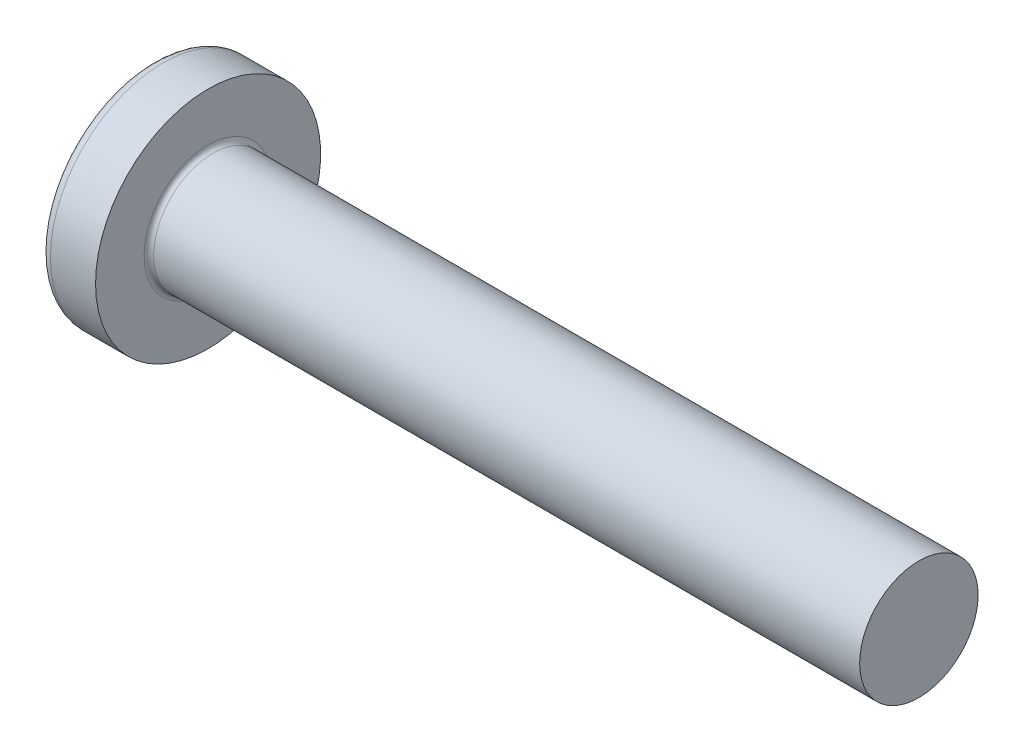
from build123d import *

# Parameters (mm, degrees)
FILLET1_R    = 0.2
RECPAT_COUNT = 2
RECPAT_ANGLE = 90


with BuildPart() as part:
    # BodySke → Base-Revolve (revolve)
    with BuildSketch(Plane.XY, mode=Mode.PRIVATE) as base_revolve_sk:
        with BuildLine():
            Line((3.7, 2.5), (3.7, 4.75))
            Line((3.7, 4.75), (1.79415598, 4.75))
            ThreePointArc((1.79415598, 4.75), (1.58538712, 4.698642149), (1.424271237, 4.556291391))
            ThreePointArc((1.424271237, 4.556291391), (0.364365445, 2.386856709), (0, 0))
            Line((0, 0), (33.7, 0))
            Line((33.7, 0), (33.7, 2.5))
            Line((33.7, 2.5), (3.7, 2.5))
        make_face()
    revolve(base_revolve_sk.sketch.rotate(Axis((1.79415598, 0, 0), (1, 0, 0)), 90), axis=Axis((1.79415598, 0, 0), (1, 0, 0)))

    # Fillet1
    fillet1_edges = [part.edges().sort_by_distance(p)[0] for p in [
        (3.7, 0, -2.5),
    ]]
    fillet(fillet1_edges, radius=FILLET1_R)

    # Sketch3 → Recess section 0
    with BuildSketch(Plane(origin=(0, 0, 0), x_dir=(0, 0, -1), z_dir=(1, 0, 0))):
        with BuildLine():
            Line((0.515, -2.35), (-0.515, -2.35))
            Line((-0.515, -2.35), (-0.515, 2.35))
            Line((-0.515, 2.35), (0.515, 2.35))
            Line((0.515, 2.35), (0.515, -2.35))
        make_face()
    # Sketch4 → Recess section 1
    with BuildSketch(Plane(origin=(2.74, 0, 0), x_dir=(0, 0, -1), z_dir=(1, 0, 0))):
        with BuildLine():
            Line((0.515, -0.983886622), (-0.515, -0.983886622))
            Line((-0.515, -0.983886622), (-0.515, 0.983886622))
            Line((-0.515, 0.983886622), (0.515, 0.983886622))
            Line((0.515, 0.983886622), (0.515, -0.983886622))
        make_face()
    recess = loft(mode=Mode.SUBTRACT)

    # RecPat: Recess ×2 about axis
    recpat_axis = Axis((0, 0, 0), (1, 0, 0))
    for i in range(1, RECPAT_COUNT):
        add(recess.rotate(recpat_axis, i * RECPAT_ANGLE / (RECPAT_COUNT - 1)), mode=Mode.SUBTRACT)

    # RecCorSke → RecessCore (revolve, cut)
    with BuildSketch(Plane.XY, mode=Mode.PRIVATE) as recesscore_sk:
        Polygon((0, 0), (0, 1.042599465), (2.74, 0.851), (3.016506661, 0), align=None)
    revolve(recesscore_sk.sketch.rotate(Axis((-3.175, 0, 0), (1, 0, 0)), 13.238159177), axis=Axis((-3.175, 0, 0), (1, 0, 0)), mode=Mode.SUBTRACT)


solid = part.part
